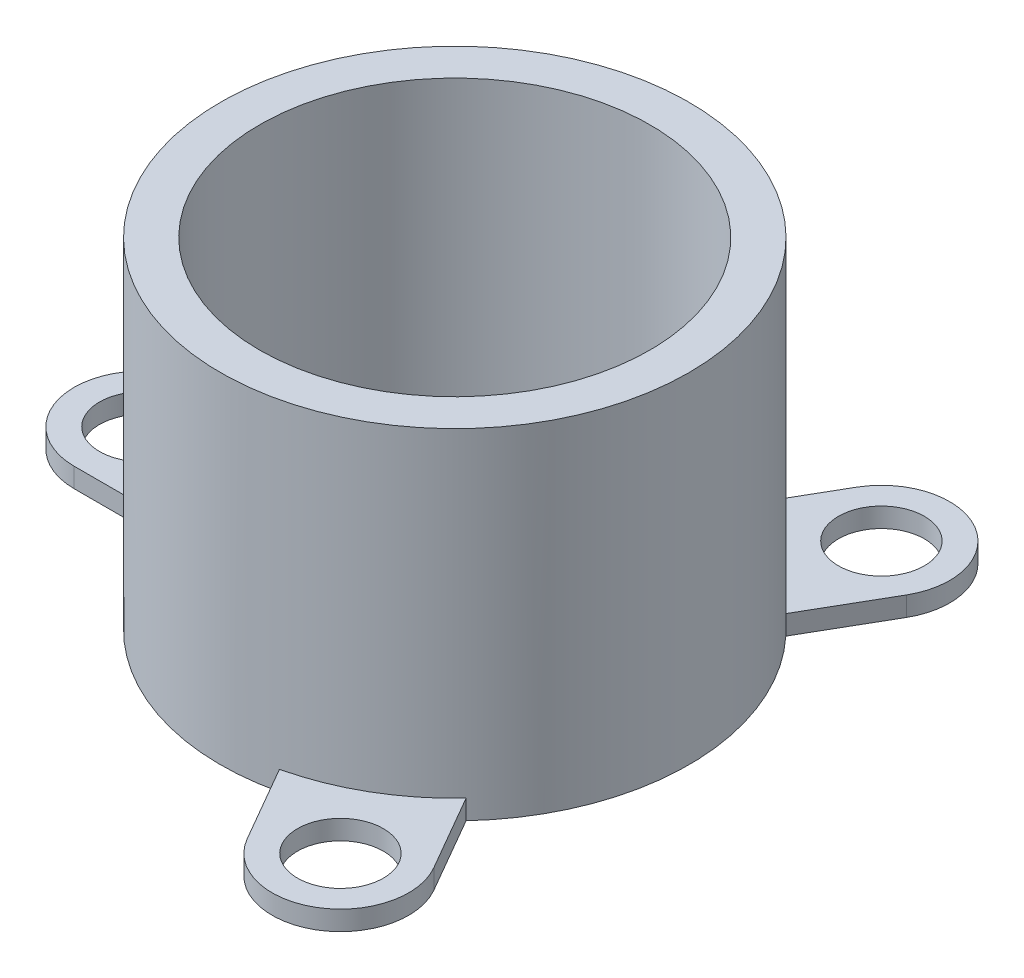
ISO-10303-21;
HEADER;
FILE_DESCRIPTION(('STEP AP214'),'2;1');
FILE_NAME('part.step','',(''),(''),'','','');
FILE_SCHEMA(('AUTOMOTIVE_DESIGN { 1 0 10303 214 1 1 1 1 }'));
ENDSEC;
DATA;
#1=APPLICATION_CONTEXT('core data for automotive mechanical design processes');
#2=APPLICATION_PROTOCOL_DEFINITION('international standard','automotive_design',2000,#1);
#3=PRODUCT_CONTEXT('',#1,'mechanical');
#4=PRODUCT('Part','Part','',(#3));
#5=PRODUCT_RELATED_PRODUCT_CATEGORY('part','',(#4));
#6=PRODUCT_DEFINITION_FORMATION('','',#4);
#7=PRODUCT_DEFINITION_CONTEXT('part definition',#1,'design');
#8=PRODUCT_DEFINITION('design','',#6,#7);
#9=PRODUCT_DEFINITION_SHAPE('','',#8);
#10=(LENGTH_UNIT() NAMED_UNIT(*) SI_UNIT(.MILLI.,.METRE.));
#11=(NAMED_UNIT(*) PLANE_ANGLE_UNIT() SI_UNIT($,.RADIAN.));
#12=(NAMED_UNIT(*) SI_UNIT($,.STERADIAN.) SOLID_ANGLE_UNIT());
#13=UNCERTAINTY_MEASURE_WITH_UNIT(LENGTH_MEASURE(1.E-05),#10,'distance_accuracy_value','');
#14=(GEOMETRIC_REPRESENTATION_CONTEXT(3) GLOBAL_UNCERTAINTY_ASSIGNED_CONTEXT((#13)) GLOBAL_UNIT_ASSIGNED_CONTEXT((#10,
#11,#12)) REPRESENTATION_CONTEXT('',''));
#15=CARTESIAN_POINT('',(0.,0.,0.));
#16=DIRECTION('',(0.,0.,1.));
#17=DIRECTION('',(1.,0.,0.));
#18=AXIS2_PLACEMENT_3D('',#15,#16,#17);
#19=CARTESIAN_POINT('',(0.,87.,0.));
#20=DIRECTION('',(0.,-1.,0.));
#21=DIRECTION('',(0.,0.,-1.));
#22=AXIS2_PLACEMENT_3D('',#19,#20,#21);
#23=CYLINDRICAL_SURFACE('',#22,60.);
#24=CARTESIAN_POINT('',(0.,87.,0.));
#25=DIRECTION('',(0.,1.,0.));
#26=DIRECTION('',(1.,0.,0.));
#27=AXIS2_PLACEMENT_3D('',#24,#25,#26);
#28=CIRCLE('',#27,60.);
#29=CARTESIAN_POINT('',(60.,87.,0.));
#30=VERTEX_POINT('',#29);
#31=EDGE_CURVE('E12',#30,#30,#28,.T.);
#32=ORIENTED_EDGE('',*,*,#31,.F.);
#33=EDGE_LOOP('',(#32));
#34=FACE_BOUND('',#33,.T.);
#35=DIRECTION('',(0.,-1.,0.));
#36=VECTOR('',#35,1.);
#37=CARTESIAN_POINT('',(43.8510452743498,5.,40.952238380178));
#38=LINE('',#37,#36);
#39=CARTESIAN_POINT('',(43.8510452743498,5.,40.952238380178));
#40=VERTEX_POINT('',#39);
#41=CARTESIAN_POINT('',(43.8510452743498,0.,40.952238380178));
#42=VERTEX_POINT('',#41);
#43=EDGE_CURVE('E144',#40,#42,#38,.T.);
#44=ORIENTED_EDGE('',*,*,#43,.T.);
#45=CARTESIAN_POINT('',(0.,0.,0.));
#46=DIRECTION('',(0.,1.,0.));
#47=DIRECTION('',(1.,0.,0.));
#48=AXIS2_PLACEMENT_3D('',#45,#46,#47);
#49=CIRCLE('',#48,60.);
#50=CARTESIAN_POINT('',(43.8510452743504,0.,-40.9522383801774));
#51=VERTEX_POINT('',#50);
#52=EDGE_CURVE('E277',#42,#51,#49,.T.);
#53=ORIENTED_EDGE('',*,*,#52,.T.);
#54=DIRECTION('',(0.,-1.,0.));
#55=VECTOR('',#54,1.);
#56=CARTESIAN_POINT('',(43.8510452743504,5.,-40.9522383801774));
#57=LINE('',#56,#55);
#58=CARTESIAN_POINT('',(43.8510452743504,5.,-40.9522383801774));
#59=VERTEX_POINT('',#58);
#60=EDGE_CURVE('E201',#59,#51,#57,.T.);
#61=ORIENTED_EDGE('',*,*,#60,.F.);
#62=CARTESIAN_POINT('',(0.,5.,0.));
#63=DIRECTION('',(0.,-1.,0.));
#64=DIRECTION('',(0.866025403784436,0.,0.500000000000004));
#65=AXIS2_PLACEMENT_3D('',#62,#63,#64);
#66=CIRCLE('',#65,60.);
#67=CARTESIAN_POINT('',(13.5401561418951,5.,-58.4522383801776));
#68=VERTEX_POINT('',#67);
#69=EDGE_CURVE('E183',#68,#59,#66,.T.);
#70=ORIENTED_EDGE('',*,*,#69,.F.);
#71=DIRECTION('',(0.,-1.,0.));
#72=VECTOR('',#71,1.);
#73=CARTESIAN_POINT('',(13.5401561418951,5.,-58.4522383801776));
#74=LINE('',#73,#72);
#75=CARTESIAN_POINT('',(13.5401561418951,0.,-58.4522383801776));
#76=VERTEX_POINT('',#75);
#77=EDGE_CURVE('E197',#68,#76,#74,.T.);
#78=ORIENTED_EDGE('',*,*,#77,.T.);
#79=CARTESIAN_POINT('',(-57.391201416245,0.,-17.5));
#80=VERTEX_POINT('',#79);
#81=EDGE_CURVE('E247',#76,#80,#49,.T.);
#82=ORIENTED_EDGE('',*,*,#81,.T.);
#83=DIRECTION('',(0.,-1.,0.));
#84=VECTOR('',#83,1.);
#85=CARTESIAN_POINT('',(-57.391201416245,5.,-17.5));
#86=LINE('',#85,#84);
#87=CARTESIAN_POINT('',(-57.391201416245,5.,-17.5));
#88=VERTEX_POINT('',#87);
#89=EDGE_CURVE('E238',#88,#80,#86,.T.);
#90=ORIENTED_EDGE('',*,*,#89,.F.);
#91=CARTESIAN_POINT('',(0.,5.,0.));
#92=DIRECTION('',(0.,-1.,0.));
#93=DIRECTION('',(0.,0.,-1.));
#94=AXIS2_PLACEMENT_3D('',#91,#92,#93);
#95=CIRCLE('',#94,60.);
#96=CARTESIAN_POINT('',(-57.391201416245,5.,17.5));
#97=VERTEX_POINT('',#96);
#98=EDGE_CURVE('E220',#97,#88,#95,.T.);
#99=ORIENTED_EDGE('',*,*,#98,.F.);
#100=DIRECTION('',(0.,-1.,0.));
#101=VECTOR('',#100,1.);
#102=CARTESIAN_POINT('',(-57.391201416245,5.,17.5));
#103=LINE('',#102,#101);
#104=CARTESIAN_POINT('',(-57.391201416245,0.,17.5));
#105=VERTEX_POINT('',#104);
#106=EDGE_CURVE('E234',#97,#105,#103,.T.);
#107=ORIENTED_EDGE('',*,*,#106,.T.);
#108=CARTESIAN_POINT('',(13.5401561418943,0.,58.4522383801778));
#109=VERTEX_POINT('',#108);
#110=EDGE_CURVE('E45',#105,#109,#49,.T.);
#111=ORIENTED_EDGE('',*,*,#110,.T.);
#112=DIRECTION('',(0.,-1.,0.));
#113=VECTOR('',#112,1.);
#114=CARTESIAN_POINT('',(13.5401561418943,5.,58.4522383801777));
#115=LINE('',#114,#113);
#116=CARTESIAN_POINT('',(13.5401561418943,5.,58.4522383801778));
#117=VERTEX_POINT('',#116);
#118=EDGE_CURVE('E56',#117,#109,#115,.T.);
#119=ORIENTED_EDGE('',*,*,#118,.F.);
#120=CARTESIAN_POINT('',(0.,5.,0.));
#121=DIRECTION('',(0.,-1.,0.));
#122=DIRECTION('',(-0.866025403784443,0.,0.499999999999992));
#123=AXIS2_PLACEMENT_3D('',#120,#121,#122);
#124=CIRCLE('',#123,60.);
#125=EDGE_CURVE('E60',#40,#117,#124,.T.);
#126=ORIENTED_EDGE('',*,*,#125,.F.);
#127=EDGE_LOOP('',(#44,#53,#61,#70,#78,#82,#90,#99,#107,#111,#119,#126));
#128=FACE_BOUND('',#127,.T.);
#129=ADVANCED_FACE('F42',(#34,#128),#23,.T.);
#130=CARTESIAN_POINT('',(0.,87.,0.));
#131=DIRECTION('',(0.,1.,0.));
#132=DIRECTION('',(0.,0.,1.));
#133=AXIS2_PLACEMENT_3D('',#130,#131,#132);
#134=PLANE('',#133);
#135=ORIENTED_EDGE('',*,*,#31,.T.);
#136=EDGE_LOOP('',(#135));
#137=FACE_BOUND('',#136,.T.);
#138=CARTESIAN_POINT('',(0.,87.,0.));
#139=DIRECTION('',(0.,1.,0.));
#140=DIRECTION('',(0.,0.,1.));
#141=AXIS2_PLACEMENT_3D('',#138,#139,#140);
#142=CIRCLE('',#141,50.);
#143=CARTESIAN_POINT('',(0.,87.,50.));
#144=VERTEX_POINT('',#143);
#145=EDGE_CURVE('E244',#144,#144,#142,.T.);
#146=ORIENTED_EDGE('',*,*,#145,.F.);
#147=EDGE_LOOP('',(#146));
#148=FACE_BOUND('',#147,.T.);
#149=ADVANCED_FACE('F266',(#137,#148),#134,.T.);
#150=CARTESIAN_POINT('',(0.,0.,0.));
#151=DIRECTION('',(0.,1.,0.));
#152=DIRECTION('',(0.,0.,1.));
#153=AXIS2_PLACEMENT_3D('',#150,#151,#152);
#154=PLANE('',#153);
#155=ORIENTED_EDGE('',*,*,#110,.F.);
#156=DIRECTION('',(1.,0.,0.));
#157=VECTOR('',#156,1.);
#158=CARTESIAN_POINT('',(0.,0.,17.5));
#159=LINE('',#158,#157);
#160=CARTESIAN_POINT('',(-80.,0.,17.5));
#161=VERTEX_POINT('',#160);
#162=EDGE_CURVE('E226',#161,#105,#159,.T.);
#163=ORIENTED_EDGE('',*,*,#162,.F.);
#164=CARTESIAN_POINT('',(-80.,0.,0.));
#165=DIRECTION('',(0.,-1.,0.));
#166=DIRECTION('',(0.,0.,-1.));
#167=AXIS2_PLACEMENT_3D('',#164,#165,#166);
#168=CIRCLE('',#167,17.5);
#169=CARTESIAN_POINT('',(-80.,0.,-17.5));
#170=VERTEX_POINT('',#169);
#171=EDGE_CURVE('E229',#161,#170,#168,.T.);
#172=ORIENTED_EDGE('',*,*,#171,.T.);
#173=DIRECTION('',(1.,0.,0.));
#174=VECTOR('',#173,1.);
#175=CARTESIAN_POINT('',(0.,0.,-17.5));
#176=LINE('',#175,#174);
#177=EDGE_CURVE('E211',#170,#80,#176,.T.);
#178=ORIENTED_EDGE('',*,*,#177,.T.);
#179=ORIENTED_EDGE('',*,*,#81,.F.);
#180=DIRECTION('',(-0.500000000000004,0.,0.866025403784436));
#181=VECTOR('',#180,1.);
#182=CARTESIAN_POINT('',(-15.1554445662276,0.,-8.75000000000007));
#183=LINE('',#182,#181);
#184=CARTESIAN_POINT('',(24.8445554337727,0.,-78.032032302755));
#185=VERTEX_POINT('',#184);
#186=EDGE_CURVE('E189',#185,#76,#183,.T.);
#187=ORIENTED_EDGE('',*,*,#186,.F.);
#188=CARTESIAN_POINT('',(40.0000000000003,0.,-69.2820323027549));
#189=DIRECTION('',(0.,-1.,0.));
#190=DIRECTION('',(0.866025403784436,0.,0.500000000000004));
#191=AXIS2_PLACEMENT_3D('',#188,#189,#190);
#192=CIRCLE('',#191,17.5);
#193=CARTESIAN_POINT('',(55.155444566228,0.,-60.5320323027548));
#194=VERTEX_POINT('',#193);
#195=EDGE_CURVE('E192',#185,#194,#192,.T.);
#196=ORIENTED_EDGE('',*,*,#195,.T.);
#197=DIRECTION('',(-0.500000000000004,0.,0.866025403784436));
#198=VECTOR('',#197,1.);
#199=CARTESIAN_POINT('',(15.1554445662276,0.,8.75000000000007));
#200=LINE('',#199,#198);
#201=EDGE_CURVE('E174',#194,#51,#200,.T.);
#202=ORIENTED_EDGE('',*,*,#201,.T.);
#203=ORIENTED_EDGE('',*,*,#52,.F.);
#204=DIRECTION('',(-0.499999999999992,0.,-0.866025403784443));
#205=VECTOR('',#204,1.);
#206=CARTESIAN_POINT('',(15.1554445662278,0.,-8.74999999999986));
#207=LINE('',#206,#205);
#208=CARTESIAN_POINT('',(55.1554445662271,0.,60.5320323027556));
#209=VERTEX_POINT('',#208);
#210=EDGE_CURVE('E160',#209,#42,#207,.T.);
#211=ORIENTED_EDGE('',*,*,#210,.F.);
#212=CARTESIAN_POINT('',(39.9999999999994,0.,69.2820323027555));
#213=DIRECTION('',(0.,-1.,0.));
#214=DIRECTION('',(-0.866025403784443,0.,0.499999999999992));
#215=AXIS2_PLACEMENT_3D('',#212,#213,#214);
#216=CIRCLE('',#215,17.5);
#217=CARTESIAN_POINT('',(24.8445554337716,0.,78.0320323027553));
#218=VERTEX_POINT('',#217);
#219=EDGE_CURVE('E135',#209,#218,#216,.T.);
#220=ORIENTED_EDGE('',*,*,#219,.T.);
#221=DIRECTION('',(-0.499999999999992,0.,-0.866025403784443));
#222=VECTOR('',#221,1.);
#223=CARTESIAN_POINT('',(-15.1554445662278,0.,8.74999999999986));
#224=LINE('',#223,#222);
#225=EDGE_CURVE('E163',#218,#109,#224,.T.);
#226=ORIENTED_EDGE('',*,*,#225,.T.);
#227=EDGE_LOOP('',(#155,#163,#172,#178,#179,#187,#196,#202,#203,#211,#220,#226));
#228=FACE_BOUND('',#227,.T.);
#229=CARTESIAN_POINT('',(0.,0.,0.));
#230=DIRECTION('',(0.,1.,0.));
#231=DIRECTION('',(0.,0.,1.));
#232=AXIS2_PLACEMENT_3D('',#229,#230,#231);
#233=CIRCLE('',#232,50.);
#234=CARTESIAN_POINT('',(0.,0.,50.));
#235=VERTEX_POINT('',#234);
#236=EDGE_CURVE('E237',#235,#235,#233,.T.);
#237=ORIENTED_EDGE('',*,*,#236,.T.);
#238=EDGE_LOOP('',(#237));
#239=FACE_BOUND('',#238,.T.);
#240=CARTESIAN_POINT('',(-80.,0.,0.));
#241=DIRECTION('',(0.,-1.,0.));
#242=DIRECTION('',(0.,0.,-1.));
#243=AXIS2_PLACEMENT_3D('',#240,#241,#242);
#244=CIRCLE('',#243,11.);
#245=CARTESIAN_POINT('',(-80.,0.,-11.));
#246=VERTEX_POINT('',#245);
#247=EDGE_CURVE('E200',#246,#246,#244,.T.);
#248=ORIENTED_EDGE('',*,*,#247,.F.);
#249=EDGE_LOOP('',(#248));
#250=FACE_BOUND('',#249,.T.);
#251=CARTESIAN_POINT('',(40.0000000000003,0.,-69.2820323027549));
#252=DIRECTION('',(0.,-1.,0.));
#253=DIRECTION('',(0.866025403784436,0.,0.500000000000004));
#254=AXIS2_PLACEMENT_3D('',#251,#252,#253);
#255=CIRCLE('',#254,11.);
#256=CARTESIAN_POINT('',(49.5262794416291,0.,-63.7820323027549));
#257=VERTEX_POINT('',#256);
#258=EDGE_CURVE('E167',#257,#257,#255,.T.);
#259=ORIENTED_EDGE('',*,*,#258,.F.);
#260=EDGE_LOOP('',(#259));
#261=FACE_BOUND('',#260,.T.);
#262=CARTESIAN_POINT('',(39.9999999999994,0.,69.2820323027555));
#263=DIRECTION('',(0.,-1.,0.));
#264=DIRECTION('',(-0.866025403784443,0.,0.499999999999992));
#265=AXIS2_PLACEMENT_3D('',#262,#263,#264);
#266=CIRCLE('',#265,11.);
#267=CARTESIAN_POINT('',(30.4737205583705,0.,74.7820323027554));
#268=VERTEX_POINT('',#267);
#269=EDGE_CURVE('E157',#268,#268,#266,.T.);
#270=ORIENTED_EDGE('',*,*,#269,.F.);
#271=EDGE_LOOP('',(#270));
#272=FACE_BOUND('',#271,.T.);
#273=ADVANCED_FACE('F251',(#228,#239,#250,#261,#272),#154,.F.);
#274=CARTESIAN_POINT('',(0.,87.,0.));
#275=DIRECTION('',(0.,-1.,0.));
#276=DIRECTION('',(0.,0.,-1.));
#277=AXIS2_PLACEMENT_3D('',#274,#275,#276);
#278=CYLINDRICAL_SURFACE('',#277,50.);
#279=ORIENTED_EDGE('',*,*,#145,.T.);
#280=EDGE_LOOP('',(#279));
#281=FACE_BOUND('',#280,.T.);
#282=ORIENTED_EDGE('',*,*,#236,.F.);
#283=EDGE_LOOP('',(#282));
#284=FACE_BOUND('',#283,.T.);
#285=ADVANCED_FACE('F254',(#281,#284),#278,.F.);
#286=CARTESIAN_POINT('',(0.,5.,17.5));
#287=DIRECTION('',(0.,0.,-1.));
#288=DIRECTION('',(-1.,0.,0.));
#289=AXIS2_PLACEMENT_3D('',#286,#287,#288);
#290=PLANE('',#289);
#291=ORIENTED_EDGE('',*,*,#162,.T.);
#292=ORIENTED_EDGE('',*,*,#106,.F.);
#293=DIRECTION('',(1.,0.,0.));
#294=VECTOR('',#293,1.);
#295=CARTESIAN_POINT('',(0.,5.,17.5));
#296=LINE('',#295,#294);
#297=CARTESIAN_POINT('',(-80.,5.,17.5));
#298=VERTEX_POINT('',#297);
#299=EDGE_CURVE('E210',#298,#97,#296,.T.);
#300=ORIENTED_EDGE('',*,*,#299,.F.);
#301=DIRECTION('',(0.,-1.,0.));
#302=VECTOR('',#301,1.);
#303=CARTESIAN_POINT('',(-80.,5.,17.5));
#304=LINE('',#303,#302);
#305=EDGE_CURVE('E223',#298,#161,#304,.T.);
#306=ORIENTED_EDGE('',*,*,#305,.T.);
#307=EDGE_LOOP('',(#291,#292,#300,#306));
#308=FACE_BOUND('',#307,.T.);
#309=ADVANCED_FACE('F256',(#308),#290,.F.);
#310=CARTESIAN_POINT('',(0.,5.,-17.5));
#311=DIRECTION('',(0.,0.,-1.));
#312=DIRECTION('',(-1.,0.,0.));
#313=AXIS2_PLACEMENT_3D('',#310,#311,#312);
#314=PLANE('',#313);
#315=ORIENTED_EDGE('',*,*,#177,.F.);
#316=DIRECTION('',(0.,-1.,0.));
#317=VECTOR('',#316,1.);
#318=CARTESIAN_POINT('',(-80.,5.,-17.5));
#319=LINE('',#318,#317);
#320=CARTESIAN_POINT('',(-80.,5.,-17.5));
#321=VERTEX_POINT('',#320);
#322=EDGE_CURVE('E241',#321,#170,#319,.T.);
#323=ORIENTED_EDGE('',*,*,#322,.F.);
#324=DIRECTION('',(1.,0.,0.));
#325=VECTOR('',#324,1.);
#326=CARTESIAN_POINT('',(0.,5.,-17.5));
#327=LINE('',#326,#325);
#328=EDGE_CURVE('E217',#321,#88,#327,.T.);
#329=ORIENTED_EDGE('',*,*,#328,.T.);
#330=ORIENTED_EDGE('',*,*,#89,.T.);
#331=EDGE_LOOP('',(#315,#323,#329,#330));
#332=FACE_BOUND('',#331,.T.);
#333=ADVANCED_FACE('F263',(#332),#314,.T.);
#334=CARTESIAN_POINT('',(-80.,5.,0.));
#335=DIRECTION('',(0.,-1.,0.));
#336=DIRECTION('',(0.,0.,-1.));
#337=AXIS2_PLACEMENT_3D('',#334,#335,#336);
#338=CYLINDRICAL_SURFACE('',#337,11.);
#339=CARTESIAN_POINT('',(-80.,5.,0.));
#340=DIRECTION('',(0.,-1.,0.));
#341=DIRECTION('',(0.,0.,-1.));
#342=AXIS2_PLACEMENT_3D('',#339,#340,#341);
#343=CIRCLE('',#342,11.);
#344=CARTESIAN_POINT('',(-80.,5.,-11.));
#345=VERTEX_POINT('',#344);
#346=EDGE_CURVE('E207',#345,#345,#343,.T.);
#347=ORIENTED_EDGE('',*,*,#346,.F.);
#348=EDGE_LOOP('',(#347));
#349=FACE_BOUND('',#348,.T.);
#350=ORIENTED_EDGE('',*,*,#247,.T.);
#351=EDGE_LOOP('',(#350));
#352=FACE_BOUND('',#351,.T.);
#353=ADVANCED_FACE('F335',(#349,#352),#338,.F.);
#354=CARTESIAN_POINT('',(-80.,5.,0.));
#355=DIRECTION('',(0.,-1.,0.));
#356=DIRECTION('',(0.,0.,-1.));
#357=AXIS2_PLACEMENT_3D('',#354,#355,#356);
#358=CYLINDRICAL_SURFACE('',#357,17.5);
#359=ORIENTED_EDGE('',*,*,#171,.F.);
#360=ORIENTED_EDGE('',*,*,#305,.F.);
#361=CARTESIAN_POINT('',(-80.,5.,0.));
#362=DIRECTION('',(0.,-1.,0.));
#363=DIRECTION('',(0.,0.,-1.));
#364=AXIS2_PLACEMENT_3D('',#361,#362,#363);
#365=CIRCLE('',#364,17.5);
#366=EDGE_CURVE('E214',#298,#321,#365,.T.);
#367=ORIENTED_EDGE('',*,*,#366,.T.);
#368=ORIENTED_EDGE('',*,*,#322,.T.);
#369=EDGE_LOOP('',(#359,#360,#367,#368));
#370=FACE_BOUND('',#369,.T.);
#371=ADVANCED_FACE('F287',(#370),#358,.T.);
#372=CARTESIAN_POINT('',(0.,5.,0.));
#373=DIRECTION('',(0.,-1.,0.));
#374=DIRECTION('',(0.,0.,-1.));
#375=AXIS2_PLACEMENT_3D('',#372,#373,#374);
#376=PLANE('',#375);
#377=ORIENTED_EDGE('',*,*,#346,.T.);
#378=EDGE_LOOP('',(#377));
#379=FACE_BOUND('',#378,.T.);
#380=ORIENTED_EDGE('',*,*,#299,.T.);
#381=ORIENTED_EDGE('',*,*,#98,.T.);
#382=ORIENTED_EDGE('',*,*,#328,.F.);
#383=ORIENTED_EDGE('',*,*,#366,.F.);
#384=EDGE_LOOP('',(#380,#381,#382,#383));
#385=FACE_BOUND('',#384,.T.);
#386=ADVANCED_FACE('F291',(#379,#385),#376,.F.);
#387=CARTESIAN_POINT('',(-15.1554445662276,5.,-8.75000000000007));
#388=DIRECTION('',(0.866025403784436,0.,0.500000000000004));
#389=DIRECTION('',(0.500000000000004,0.,-0.866025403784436));
#390=AXIS2_PLACEMENT_3D('',#387,#388,#389);
#391=PLANE('',#390);
#392=ORIENTED_EDGE('',*,*,#186,.T.);
#393=ORIENTED_EDGE('',*,*,#77,.F.);
#394=DIRECTION('',(-0.500000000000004,0.,0.866025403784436));
#395=VECTOR('',#394,1.);
#396=CARTESIAN_POINT('',(-15.1554445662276,5.,-8.75000000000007));
#397=LINE('',#396,#395);
#398=CARTESIAN_POINT('',(24.8445554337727,5.,-78.032032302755));
#399=VERTEX_POINT('',#398);
#400=EDGE_CURVE('E173',#399,#68,#397,.T.);
#401=ORIENTED_EDGE('',*,*,#400,.F.);
#402=DIRECTION('',(0.,-1.,0.));
#403=VECTOR('',#402,1.);
#404=CARTESIAN_POINT('',(24.8445554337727,5.,-78.032032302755));
#405=LINE('',#404,#403);
#406=EDGE_CURVE('E186',#399,#185,#405,.T.);
#407=ORIENTED_EDGE('',*,*,#406,.T.);
#408=EDGE_LOOP('',(#392,#393,#401,#407));
#409=FACE_BOUND('',#408,.T.);
#410=ADVANCED_FACE('F319',(#409),#391,.F.);
#411=CARTESIAN_POINT('',(15.1554445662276,5.,8.75000000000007));
#412=DIRECTION('',(0.866025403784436,0.,0.500000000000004));
#413=DIRECTION('',(0.500000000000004,0.,-0.866025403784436));
#414=AXIS2_PLACEMENT_3D('',#411,#412,#413);
#415=PLANE('',#414);
#416=ORIENTED_EDGE('',*,*,#201,.F.);
#417=DIRECTION('',(0.,-1.,0.));
#418=VECTOR('',#417,1.);
#419=CARTESIAN_POINT('',(55.155444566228,5.,-60.5320323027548));
#420=LINE('',#419,#418);
#421=CARTESIAN_POINT('',(55.155444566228,5.,-60.5320323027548));
#422=VERTEX_POINT('',#421);
#423=EDGE_CURVE('E204',#422,#194,#420,.T.);
#424=ORIENTED_EDGE('',*,*,#423,.F.);
#425=DIRECTION('',(-0.500000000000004,0.,0.866025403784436));
#426=VECTOR('',#425,1.);
#427=CARTESIAN_POINT('',(15.1554445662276,5.,8.75000000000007));
#428=LINE('',#427,#426);
#429=EDGE_CURVE('E180',#422,#59,#428,.T.);
#430=ORIENTED_EDGE('',*,*,#429,.T.);
#431=ORIENTED_EDGE('',*,*,#60,.T.);
#432=EDGE_LOOP('',(#416,#424,#430,#431));
#433=FACE_BOUND('',#432,.T.);
#434=ADVANCED_FACE('F315',(#433),#415,.T.);
#435=CARTESIAN_POINT('',(40.0000000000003,5.,-69.2820323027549));
#436=DIRECTION('',(0.,-1.,0.));
#437=DIRECTION('',(0.,0.,-1.));
#438=AXIS2_PLACEMENT_3D('',#435,#436,#437);
#439=CYLINDRICAL_SURFACE('',#438,11.);
#440=CARTESIAN_POINT('',(40.0000000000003,5.,-69.2820323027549));
#441=DIRECTION('',(0.,-1.,0.));
#442=DIRECTION('',(0.866025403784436,0.,0.500000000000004));
#443=AXIS2_PLACEMENT_3D('',#440,#441,#442);
#444=CIRCLE('',#443,11.);
#445=CARTESIAN_POINT('',(49.5262794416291,5.,-63.7820323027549));
#446=VERTEX_POINT('',#445);
#447=EDGE_CURVE('E170',#446,#446,#444,.T.);
#448=ORIENTED_EDGE('',*,*,#447,.F.);
#449=EDGE_LOOP('',(#448));
#450=FACE_BOUND('',#449,.T.);
#451=ORIENTED_EDGE('',*,*,#258,.T.);
#452=EDGE_LOOP('',(#451));
#453=FACE_BOUND('',#452,.T.);
#454=ADVANCED_FACE('F318',(#450,#453),#439,.F.);
#455=CARTESIAN_POINT('',(40.0000000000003,5.,-69.2820323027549));
#456=DIRECTION('',(0.,-1.,0.));
#457=DIRECTION('',(0.,0.,-1.));
#458=AXIS2_PLACEMENT_3D('',#455,#456,#457);
#459=CYLINDRICAL_SURFACE('',#458,17.5);
#460=ORIENTED_EDGE('',*,*,#195,.F.);
#461=ORIENTED_EDGE('',*,*,#406,.F.);
#462=CARTESIAN_POINT('',(40.0000000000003,5.,-69.2820323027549));
#463=DIRECTION('',(0.,-1.,0.));
#464=DIRECTION('',(0.866025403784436,0.,0.500000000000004));
#465=AXIS2_PLACEMENT_3D('',#462,#463,#464);
#466=CIRCLE('',#465,17.5);
#467=EDGE_CURVE('E177',#399,#422,#466,.T.);
#468=ORIENTED_EDGE('',*,*,#467,.T.);
#469=ORIENTED_EDGE('',*,*,#423,.T.);
#470=EDGE_LOOP('',(#460,#461,#468,#469));
#471=FACE_BOUND('',#470,.T.);
#472=ADVANCED_FACE('F313',(#471),#459,.T.);
#473=CARTESIAN_POINT('',(0.,5.,0.));
#474=DIRECTION('',(0.,-1.,0.));
#475=DIRECTION('',(0.866025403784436,0.,0.500000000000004));
#476=AXIS2_PLACEMENT_3D('',#473,#474,#475);
#477=PLANE('',#476);
#478=ORIENTED_EDGE('',*,*,#447,.T.);
#479=EDGE_LOOP('',(#478));
#480=FACE_BOUND('',#479,.T.);
#481=ORIENTED_EDGE('',*,*,#400,.T.);
#482=ORIENTED_EDGE('',*,*,#69,.T.);
#483=ORIENTED_EDGE('',*,*,#429,.F.);
#484=ORIENTED_EDGE('',*,*,#467,.F.);
#485=EDGE_LOOP('',(#481,#482,#483,#484));
#486=FACE_BOUND('',#485,.T.);
#487=ADVANCED_FACE('F305',(#480,#486),#477,.F.);
#488=CARTESIAN_POINT('',(15.1554445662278,5.,-8.74999999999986));
#489=DIRECTION('',(-0.866025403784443,0.,0.499999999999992));
#490=DIRECTION('',(0.499999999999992,0.,0.866025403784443));
#491=AXIS2_PLACEMENT_3D('',#488,#489,#490);
#492=PLANE('',#491);
#493=ORIENTED_EDGE('',*,*,#210,.T.);
#494=ORIENTED_EDGE('',*,*,#43,.F.);
#495=DIRECTION('',(-0.499999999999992,0.,-0.866025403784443));
#496=VECTOR('',#495,1.);
#497=CARTESIAN_POINT('',(15.1554445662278,5.,-8.74999999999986));
#498=LINE('',#497,#496);
#499=CARTESIAN_POINT('',(55.1554445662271,5.,60.5320323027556));
#500=VERTEX_POINT('',#499);
#501=EDGE_CURVE('E142',#500,#40,#498,.T.);
#502=ORIENTED_EDGE('',*,*,#501,.F.);
#503=DIRECTION('',(0.,-1.,0.));
#504=VECTOR('',#503,1.);
#505=CARTESIAN_POINT('',(55.1554445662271,5.,60.5320323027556));
#506=LINE('',#505,#504);
#507=EDGE_CURVE('E129',#500,#209,#506,.T.);
#508=ORIENTED_EDGE('',*,*,#507,.T.);
#509=EDGE_LOOP('',(#493,#494,#502,#508));
#510=FACE_BOUND('',#509,.T.);
#511=ADVANCED_FACE('F143',(#510),#492,.F.);
#512=CARTESIAN_POINT('',(-15.1554445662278,5.,8.74999999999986));
#513=DIRECTION('',(-0.866025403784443,0.,0.499999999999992));
#514=DIRECTION('',(0.499999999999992,0.,0.866025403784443));
#515=AXIS2_PLACEMENT_3D('',#512,#513,#514);
#516=PLANE('',#515);
#517=ORIENTED_EDGE('',*,*,#225,.F.);
#518=DIRECTION('',(0.,-1.,0.));
#519=VECTOR('',#518,1.);
#520=CARTESIAN_POINT('',(24.8445554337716,5.,78.0320323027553));
#521=LINE('',#520,#519);
#522=CARTESIAN_POINT('',(24.8445554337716,5.,78.0320323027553));
#523=VERTEX_POINT('',#522);
#524=EDGE_CURVE('E139',#523,#218,#521,.T.);
#525=ORIENTED_EDGE('',*,*,#524,.F.);
#526=DIRECTION('',(-0.499999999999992,0.,-0.866025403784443));
#527=VECTOR('',#526,1.);
#528=CARTESIAN_POINT('',(-15.1554445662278,5.,8.74999999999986));
#529=LINE('',#528,#527);
#530=EDGE_CURVE('E151',#523,#117,#529,.T.);
#531=ORIENTED_EDGE('',*,*,#530,.T.);
#532=ORIENTED_EDGE('',*,*,#118,.T.);
#533=EDGE_LOOP('',(#517,#525,#531,#532));
#534=FACE_BOUND('',#533,.T.);
#535=ADVANCED_FACE('F295',(#534),#516,.T.);
#536=CARTESIAN_POINT('',(39.9999999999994,5.,69.2820323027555));
#537=DIRECTION('',(0.,-1.,0.));
#538=DIRECTION('',(0.,0.,-1.));
#539=AXIS2_PLACEMENT_3D('',#536,#537,#538);
#540=CYLINDRICAL_SURFACE('',#539,11.);
#541=CARTESIAN_POINT('',(39.9999999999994,5.,69.2820323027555));
#542=DIRECTION('',(0.,-1.,0.));
#543=DIRECTION('',(-0.866025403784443,0.,0.499999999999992));
#544=AXIS2_PLACEMENT_3D('',#541,#542,#543);
#545=CIRCLE('',#544,11.);
#546=CARTESIAN_POINT('',(30.4737205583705,5.,74.7820323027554));
#547=VERTEX_POINT('',#546);
#548=EDGE_CURVE('E146',#547,#547,#545,.T.);
#549=ORIENTED_EDGE('',*,*,#548,.F.);
#550=EDGE_LOOP('',(#549));
#551=FACE_BOUND('',#550,.T.);
#552=ORIENTED_EDGE('',*,*,#269,.T.);
#553=EDGE_LOOP('',(#552));
#554=FACE_BOUND('',#553,.T.);
#555=ADVANCED_FACE('F297',(#551,#554),#540,.F.);
#556=CARTESIAN_POINT('',(39.9999999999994,5.,69.2820323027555));
#557=DIRECTION('',(0.,-1.,0.));
#558=DIRECTION('',(0.,0.,-1.));
#559=AXIS2_PLACEMENT_3D('',#556,#557,#558);
#560=CYLINDRICAL_SURFACE('',#559,17.5);
#561=ORIENTED_EDGE('',*,*,#219,.F.);
#562=ORIENTED_EDGE('',*,*,#507,.F.);
#563=CARTESIAN_POINT('',(39.9999999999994,5.,69.2820323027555));
#564=DIRECTION('',(0.,-1.,0.));
#565=DIRECTION('',(-0.866025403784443,0.,0.499999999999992));
#566=AXIS2_PLACEMENT_3D('',#563,#564,#565);
#567=CIRCLE('',#566,17.5);
#568=EDGE_CURVE('E133',#500,#523,#567,.T.);
#569=ORIENTED_EDGE('',*,*,#568,.T.);
#570=ORIENTED_EDGE('',*,*,#524,.T.);
#571=EDGE_LOOP('',(#561,#562,#569,#570));
#572=FACE_BOUND('',#571,.T.);
#573=ADVANCED_FACE('F131',(#572),#560,.T.);
#574=CARTESIAN_POINT('',(0.,5.,0.));
#575=DIRECTION('',(0.,-1.,0.));
#576=DIRECTION('',(-0.866025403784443,0.,0.499999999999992));
#577=AXIS2_PLACEMENT_3D('',#574,#575,#576);
#578=PLANE('',#577);
#579=ORIENTED_EDGE('',*,*,#548,.T.);
#580=EDGE_LOOP('',(#579));
#581=FACE_BOUND('',#580,.T.);
#582=ORIENTED_EDGE('',*,*,#501,.T.);
#583=ORIENTED_EDGE('',*,*,#125,.T.);
#584=ORIENTED_EDGE('',*,*,#530,.F.);
#585=ORIENTED_EDGE('',*,*,#568,.F.);
#586=EDGE_LOOP('',(#582,#583,#584,#585));
#587=FACE_BOUND('',#586,.T.);
#588=ADVANCED_FACE('F149',(#581,#587),#578,.F.);
#589=CLOSED_SHELL('',(#129,#149,#273,#285,#309,#333,#353,#371,#386,#410,#434,#454,#472,#487,
#511,#535,#555,#573,#588));
#590=MANIFOLD_SOLID_BREP('B2',#589);
#591=ADVANCED_BREP_SHAPE_REPRESENTATION('',(#18,#590),#14);
#592=SHAPE_DEFINITION_REPRESENTATION(#9,#591);
ENDSEC;
END-ISO-10303-21;
